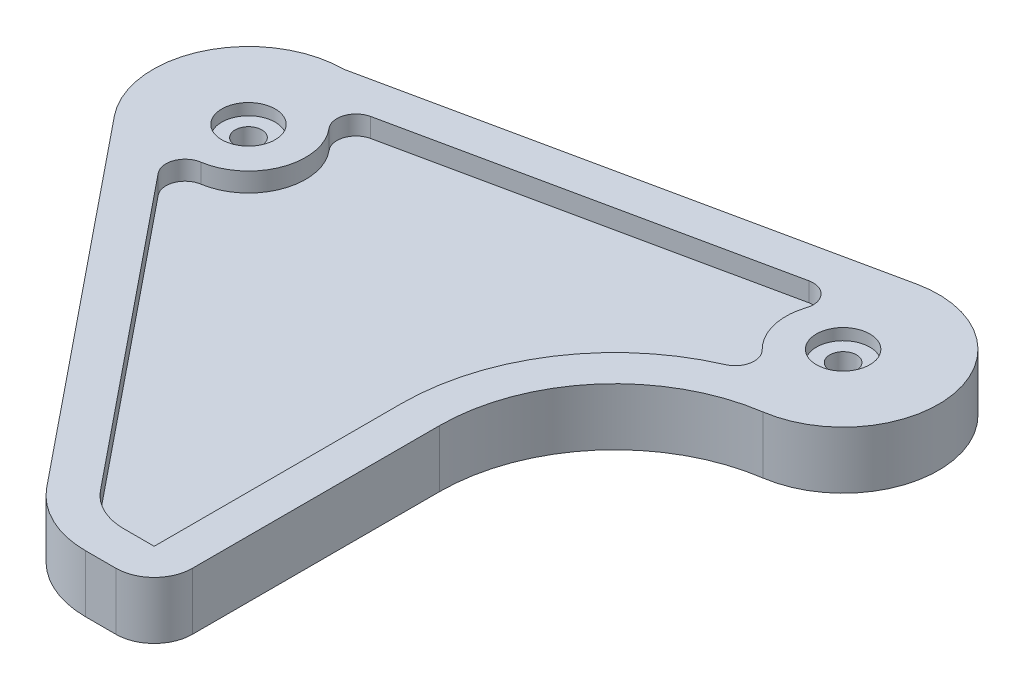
ISO-10303-21;
HEADER;
FILE_DESCRIPTION(('STEP AP214'),'2;1');
FILE_NAME('part.step','',(''),(''),'','','');
FILE_SCHEMA(('AUTOMOTIVE_DESIGN { 1 0 10303 214 1 1 1 1 }'));
ENDSEC;
DATA;
#1=APPLICATION_CONTEXT('core data for automotive mechanical design processes');
#2=APPLICATION_PROTOCOL_DEFINITION('international standard','automotive_design',2000,#1);
#3=PRODUCT_CONTEXT('',#1,'mechanical');
#4=PRODUCT('Part','Part','',(#3));
#5=PRODUCT_RELATED_PRODUCT_CATEGORY('part','',(#4));
#6=PRODUCT_DEFINITION_FORMATION('','',#4);
#7=PRODUCT_DEFINITION_CONTEXT('part definition',#1,'design');
#8=PRODUCT_DEFINITION('design','',#6,#7);
#9=PRODUCT_DEFINITION_SHAPE('','',#8);
#10=(LENGTH_UNIT() NAMED_UNIT(*) SI_UNIT(.MILLI.,.METRE.));
#11=(NAMED_UNIT(*) PLANE_ANGLE_UNIT() SI_UNIT($,.RADIAN.));
#12=(NAMED_UNIT(*) SI_UNIT($,.STERADIAN.) SOLID_ANGLE_UNIT());
#13=UNCERTAINTY_MEASURE_WITH_UNIT(LENGTH_MEASURE(1.E-05),#10,'distance_accuracy_value','');
#14=(GEOMETRIC_REPRESENTATION_CONTEXT(3) GLOBAL_UNCERTAINTY_ASSIGNED_CONTEXT((#13)) GLOBAL_UNIT_ASSIGNED_CONTEXT((#10,
#11,#12)) REPRESENTATION_CONTEXT('',''));
#15=CARTESIAN_POINT('',(0.,0.,0.));
#16=DIRECTION('',(0.,0.,1.));
#17=DIRECTION('',(1.,0.,0.));
#18=AXIS2_PLACEMENT_3D('',#15,#16,#17);
#19=CARTESIAN_POINT('',(0.,15.,0.));
#20=DIRECTION('',(0.,1.,0.));
#21=DIRECTION('',(0.,0.,1.));
#22=AXIS2_PLACEMENT_3D('',#19,#20,#21);
#23=PLANE('',#22);
#24=CARTESIAN_POINT('',(0.,15.,0.));
#25=DIRECTION('',(0.,1.,0.));
#26=DIRECTION('',(0.,0.,1.));
#27=AXIS2_PLACEMENT_3D('',#24,#25,#26);
#28=CIRCLE('',#27,6.9999987);
#29=CARTESIAN_POINT('',(0.,15.,6.9999987));
#30=VERTEX_POINT('',#29);
#31=EDGE_CURVE('E559',#30,#30,#28,.T.);
#32=ORIENTED_EDGE('',*,*,#31,.F.);
#33=EDGE_LOOP('',(#32));
#34=FACE_BOUND('',#33,.T.);
#35=CARTESIAN_POINT('',(129.,15.,-26.8612815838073));
#36=DIRECTION('',(0.,1.,0.));
#37=DIRECTION('',(0.,0.,1.));
#38=AXIS2_PLACEMENT_3D('',#35,#36,#37);
#39=CIRCLE('',#38,6.99999870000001);
#40=CARTESIAN_POINT('',(129.,15.,-19.8612828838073));
#41=VERTEX_POINT('',#40);
#42=EDGE_CURVE('E569',#41,#41,#39,.T.);
#43=ORIENTED_EDGE('',*,*,#42,.F.);
#44=EDGE_LOOP('',(#43));
#45=FACE_BOUND('',#44,.T.);
#46=CARTESIAN_POINT('',(0.,15.,0.));
#47=DIRECTION('',(0.,1.,0.));
#48=DIRECTION('',(0.,0.,1.));
#49=AXIS2_PLACEMENT_3D('',#46,#47,#48);
#50=CIRCLE('',#49,25.);
#51=CARTESIAN_POINT('',(0.,15.,-25.));
#52=VERTEX_POINT('',#51);
#53=CARTESIAN_POINT('',(-19.4286490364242,15.,15.733009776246));
#54=VERTEX_POINT('',#53);
#55=EDGE_CURVE('E294',#52,#54,#50,.T.);
#56=ORIENTED_EDGE('',*,*,#55,.T.);
#57=DIRECTION('',(0.629320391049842,0.,0.777145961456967));
#58=VECTOR('',#57,1.);
#59=CARTESIAN_POINT('',(55.9935980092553,15.,108.871728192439));
#60=LINE('',#59,#58);
#61=CARTESIAN_POINT('',(55.9935980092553,15.,108.871728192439));
#62=VERTEX_POINT('',#61);
#63=EDGE_CURVE('E296',#54,#62,#60,.T.);
#64=ORIENTED_EDGE('',*,*,#63,.T.);
#65=CARTESIAN_POINT('',(75.4222470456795,15.,93.1387184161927));
#66=DIRECTION('',(0.,1.,0.));
#67=DIRECTION('',(0.,0.,1.));
#68=AXIS2_PLACEMENT_3D('',#65,#66,#67);
#69=CIRCLE('',#68,25.);
#70=CARTESIAN_POINT('',(75.4222470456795,15.,118.138718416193));
#71=VERTEX_POINT('',#70);
#72=EDGE_CURVE('E298',#62,#71,#69,.T.);
#73=ORIENTED_EDGE('',*,*,#72,.T.);
#74=DIRECTION('',(1.,0.,0.));
#75=VECTOR('',#74,1.);
#76=CARTESIAN_POINT('',(75.4222470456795,15.,118.138718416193));
#77=LINE('',#76,#75);
#78=CARTESIAN_POINT('',(83.4222470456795,15.,118.138718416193));
#79=VERTEX_POINT('',#78);
#80=EDGE_CURVE('E300',#71,#79,#77,.T.);
#81=ORIENTED_EDGE('',*,*,#80,.T.);
#82=CARTESIAN_POINT('',(83.4222470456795,15.,108.138718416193));
#83=DIRECTION('',(0.,1.,0.));
#84=DIRECTION('',(0.,0.,1.));
#85=AXIS2_PLACEMENT_3D('',#82,#83,#84);
#86=CIRCLE('',#85,9.99999999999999);
#87=CARTESIAN_POINT('',(93.4222470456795,15.,108.138718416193));
#88=VERTEX_POINT('',#87);
#89=EDGE_CURVE('E302',#79,#88,#86,.T.);
#90=ORIENTED_EDGE('',*,*,#89,.T.);
#91=DIRECTION('',(0.,0.,-1.));
#92=VECTOR('',#91,1.);
#93=CARTESIAN_POINT('',(93.4222470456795,15.,43.369600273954));
#94=LINE('',#93,#92);
#95=CARTESIAN_POINT('',(93.4222470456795,15.,43.369600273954));
#96=VERTEX_POINT('',#95);
#97=EDGE_CURVE('E304',#88,#96,#94,.T.);
#98=ORIENTED_EDGE('',*,*,#97,.T.);
#99=CARTESIAN_POINT('',(139.422247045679,15.,43.369600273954));
#100=DIRECTION('',(0.,-1.,0.));
#101=DIRECTION('',(0.,0.,1.));
#102=AXIS2_PLACEMENT_3D('',#99,#100,#101);
#103=CIRCLE('',#102,46.);
#104=CARTESIAN_POINT('',(132.669805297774,15.,-2.13209783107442));
#105=VERTEX_POINT('',#104);
#106=EDGE_CURVE('E306',#96,#105,#103,.T.);
#107=ORIENTED_EDGE('',*,*,#106,.T.);
#108=CARTESIAN_POINT('',(129.,15.,-26.8612815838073));
#109=DIRECTION('',(0.,1.,0.));
#110=DIRECTION('',(0.,0.,-1.));
#111=AXIS2_PLACEMENT_3D('',#108,#109,#110);
#112=CIRCLE('',#111,25.);
#113=CARTESIAN_POINT('',(123.802207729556,15.,-51.3149716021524));
#114=VERTEX_POINT('',#113);
#115=EDGE_CURVE('E308',#105,#114,#112,.T.);
#116=ORIENTED_EDGE('',*,*,#115,.T.);
#117=DIRECTION('',(-0.978147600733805,0.,0.207911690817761));
#118=VECTOR('',#117,1.);
#119=CARTESIAN_POINT('',(0.,15.,-25.));
#120=LINE('',#119,#118);
#121=EDGE_CURVE('E52',#114,#52,#120,.T.);
#122=ORIENTED_EDGE('',*,*,#121,.T.);
#123=EDGE_LOOP('',(#56,#64,#73,#81,#90,#98,#107,#116,#122));
#124=FACE_BOUND('',#123,.T.);
#125=DIRECTION('',(-0.978147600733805,0.,0.207911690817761));
#126=VECTOR('',#125,1.);
#127=CARTESIAN_POINT('',(-136.322850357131,15.,14.1997222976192));
#128=LINE('',#127,#126);
#129=CARTESIAN_POINT('',(108.939311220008,15.,-37.9323594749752));
#130=VERTEX_POINT('',#129);
#131=CARTESIAN_POINT('',(14.2344029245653,15.,-17.802209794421));
#132=VERTEX_POINT('',#131);
#133=EDGE_CURVE('E190',#130,#132,#128,.T.);
#134=ORIENTED_EDGE('',*,*,#133,.F.);
#135=CARTESIAN_POINT('',(109.978869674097,15.,-33.0416214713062));
#136=DIRECTION('',(0.,1.,0.));
#137=DIRECTION('',(0.,0.,1.));
#138=AXIS2_PLACEMENT_3D('',#135,#136,#137);
#139=CIRCLE('',#138,5.00000000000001);
#140=CARTESIAN_POINT('',(114.734152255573,15.,-31.4965364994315));
#141=VERTEX_POINT('',#140);
#142=EDGE_CURVE('E44',#130,#141,#139,.F.);
#143=ORIENTED_EDGE('',*,*,#142,.T.);
#144=CARTESIAN_POINT('',(129.,15.,-26.8612815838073));
#145=DIRECTION('',(0.,1.,0.));
#146=DIRECTION('',(0.,0.,1.));
#147=AXIS2_PLACEMENT_3D('',#144,#145,#146);
#148=CIRCLE('',#147,15.);
#149=CARTESIAN_POINT('',(118.526682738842,15.,-16.1230496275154));
#150=VERTEX_POINT('',#149);
#151=EDGE_CURVE('E222',#141,#150,#148,.T.);
#152=ORIENTED_EDGE('',*,*,#151,.T.);
#153=CARTESIAN_POINT('',(115.035576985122,15.,-12.5436389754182));
#154=DIRECTION('',(0.,1.,0.));
#155=DIRECTION('',(0.,0.,1.));
#156=AXIS2_PLACEMENT_3D('',#153,#154,#155);
#157=CIRCLE('',#156,5.);
#158=CARTESIAN_POINT('',(117.034484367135,15.,-7.96058657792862));
#159=VERTEX_POINT('',#158);
#160=EDGE_CURVE('E219',#159,#150,#157,.T.);
#161=ORIENTED_EDGE('',*,*,#160,.F.);
#162=CARTESIAN_POINT('',(139.422247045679,15.,43.369600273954));
#163=DIRECTION('',(0.,1.,0.));
#164=DIRECTION('',(0.,0.,1.));
#165=AXIS2_PLACEMENT_3D('',#162,#163,#164);
#166=CIRCLE('',#165,56.);
#167=CARTESIAN_POINT('',(83.4222470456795,15.,43.369600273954));
#168=VERTEX_POINT('',#167);
#169=EDGE_CURVE('E216',#159,#168,#166,.T.);
#170=ORIENTED_EDGE('',*,*,#169,.T.);
#171=DIRECTION('',(0.,0.,-1.));
#172=VECTOR('',#171,1.);
#173=CARTESIAN_POINT('',(83.4222470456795,15.,11.7196443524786));
#174=LINE('',#173,#172);
#175=CARTESIAN_POINT('',(83.4222470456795,15.,108.138718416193));
#176=VERTEX_POINT('',#175);
#177=EDGE_CURVE('E213',#176,#168,#174,.T.);
#178=ORIENTED_EDGE('',*,*,#177,.F.);
#179=DIRECTION('',(1.,0.,0.));
#180=VECTOR('',#179,1.);
#181=CARTESIAN_POINT('',(-136.850007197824,15.,108.138718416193));
#182=LINE('',#181,#180);
#183=CARTESIAN_POINT('',(75.4222470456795,15.,108.138718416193));
#184=VERTEX_POINT('',#183);
#185=EDGE_CURVE('E210',#184,#176,#182,.T.);
#186=ORIENTED_EDGE('',*,*,#185,.F.);
#187=CARTESIAN_POINT('',(75.4222470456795,15.,93.1387184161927));
#188=DIRECTION('',(0.,1.,0.));
#189=DIRECTION('',(0.,0.,1.));
#190=AXIS2_PLACEMENT_3D('',#187,#188,#189);
#191=CIRCLE('',#190,15.);
#192=CARTESIAN_POINT('',(63.765057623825,15.,102.57852428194));
#193=VERTEX_POINT('',#192);
#194=EDGE_CURVE('E207',#193,#184,#191,.T.);
#195=ORIENTED_EDGE('',*,*,#194,.F.);
#196=DIRECTION('',(0.629320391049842,0.,0.777145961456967));
#197=VECTOR('',#196,1.);
#198=CARTESIAN_POINT('',(-60.1240638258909,15.,-50.4117995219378));
#199=LINE('',#198,#197);
#200=CARTESIAN_POINT('',(-0.757040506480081,15.,22.9003687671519));
#201=VERTEX_POINT('',#200);
#202=EDGE_CURVE('E204',#201,#193,#199,.T.);
#203=ORIENTED_EDGE('',*,*,#202,.F.);
#204=CARTESIAN_POINT('',(3.12868930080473,15.,19.7537668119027));
#205=DIRECTION('',(0.,1.,0.));
#206=DIRECTION('',(0.,0.,1.));
#207=AXIS2_PLACEMENT_3D('',#204,#205,#206);
#208=CIRCLE('',#207,5.);
#209=CARTESIAN_POINT('',(2.34651697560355,15.,14.815325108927));
#210=VERTEX_POINT('',#209);
#211=EDGE_CURVE('E198',#210,#201,#208,.T.);
#212=ORIENTED_EDGE('',*,*,#211,.F.);
#213=CARTESIAN_POINT('',(0.,15.,0.));
#214=DIRECTION('',(0.,1.,0.));
#215=DIRECTION('',(0.,0.,1.));
#216=AXIS2_PLACEMENT_3D('',#213,#214,#215);
#217=CIRCLE('',#216,15.);
#218=CARTESIAN_POINT('',(11.4554710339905,15.,-9.683603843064));
#219=VERTEX_POINT('',#218);
#220=EDGE_CURVE('E196',#210,#219,#217,.T.);
#221=ORIENTED_EDGE('',*,*,#220,.T.);
#222=CARTESIAN_POINT('',(15.2739613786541,15.,-12.911471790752));
#223=DIRECTION('',(0.,1.,0.));
#224=DIRECTION('',(0.,0.,1.));
#225=AXIS2_PLACEMENT_3D('',#222,#223,#224);
#226=CIRCLE('',#225,5.);
#227=EDGE_CURVE('E179',#132,#219,#226,.T.);
#228=ORIENTED_EDGE('',*,*,#227,.F.);
#229=EDGE_LOOP('',(#134,#143,#152,#161,#170,#178,#186,#195,#203,#212,#221,#228));
#230=FACE_BOUND('',#229,.T.);
#231=ADVANCED_FACE('F29',(#34,#45,#124,#230),#23,.T.);
#232=CARTESIAN_POINT('',(0.,15.,0.));
#233=DIRECTION('',(0.,-1.,0.));
#234=DIRECTION('',(0.,0.,-1.));
#235=AXIS2_PLACEMENT_3D('',#232,#233,#234);
#236=CYLINDRICAL_SURFACE('',#235,25.);
#237=CARTESIAN_POINT('',(0.,0.,0.));
#238=DIRECTION('',(0.,1.,0.));
#239=DIRECTION('',(0.,0.,1.));
#240=AXIS2_PLACEMENT_3D('',#237,#238,#239);
#241=CIRCLE('',#240,25.);
#242=CARTESIAN_POINT('',(0.,0.,-25.));
#243=VERTEX_POINT('',#242);
#244=CARTESIAN_POINT('',(-19.4286490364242,0.,15.733009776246));
#245=VERTEX_POINT('',#244);
#246=EDGE_CURVE('E257',#243,#245,#241,.T.);
#247=ORIENTED_EDGE('',*,*,#246,.T.);
#248=DIRECTION('',(0.,-1.,0.));
#249=VECTOR('',#248,1.);
#250=CARTESIAN_POINT('',(-19.4286490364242,15.,15.733009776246));
#251=LINE('',#250,#249);
#252=EDGE_CURVE('E11',#54,#245,#251,.T.);
#253=ORIENTED_EDGE('',*,*,#252,.F.);
#254=ORIENTED_EDGE('',*,*,#55,.F.);
#255=DIRECTION('',(0.,-1.,0.));
#256=VECTOR('',#255,1.);
#257=CARTESIAN_POINT('',(0.,15.,-25.));
#258=LINE('',#257,#256);
#259=EDGE_CURVE('E311',#52,#243,#258,.T.);
#260=ORIENTED_EDGE('',*,*,#259,.T.);
#261=EDGE_LOOP('',(#247,#253,#254,#260));
#262=FACE_BOUND('',#261,.T.);
#263=ADVANCED_FACE('F31',(#262),#236,.T.);
#264=CARTESIAN_POINT('',(55.9935980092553,15.,108.871728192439));
#265=DIRECTION('',(0.777145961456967,0.,-0.629320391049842));
#266=DIRECTION('',(-0.629320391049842,0.,-0.777145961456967));
#267=AXIS2_PLACEMENT_3D('',#264,#265,#266);
#268=PLANE('',#267);
#269=DIRECTION('',(0.629320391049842,0.,0.777145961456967));
#270=VECTOR('',#269,1.);
#271=CARTESIAN_POINT('',(55.9935980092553,0.,108.871728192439));
#272=LINE('',#271,#270);
#273=CARTESIAN_POINT('',(55.9935980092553,0.,108.871728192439));
#274=VERTEX_POINT('',#273);
#275=EDGE_CURVE('E278',#245,#274,#272,.T.);
#276=ORIENTED_EDGE('',*,*,#275,.T.);
#277=DIRECTION('',(0.,-1.,0.));
#278=VECTOR('',#277,1.);
#279=CARTESIAN_POINT('',(55.9935980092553,15.,108.871728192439));
#280=LINE('',#279,#278);
#281=EDGE_CURVE('E37',#62,#274,#280,.T.);
#282=ORIENTED_EDGE('',*,*,#281,.F.);
#283=ORIENTED_EDGE('',*,*,#63,.F.);
#284=ORIENTED_EDGE('',*,*,#252,.T.);
#285=EDGE_LOOP('',(#276,#282,#283,#284));
#286=FACE_BOUND('',#285,.T.);
#287=ADVANCED_FACE('F357',(#286),#268,.F.);
#288=CARTESIAN_POINT('',(75.4222470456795,15.,93.1387184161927));
#289=DIRECTION('',(0.,-1.,0.));
#290=DIRECTION('',(0.,0.,-1.));
#291=AXIS2_PLACEMENT_3D('',#288,#289,#290);
#292=CYLINDRICAL_SURFACE('',#291,25.);
#293=CARTESIAN_POINT('',(75.4222470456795,0.,93.1387184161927));
#294=DIRECTION('',(0.,1.,0.));
#295=DIRECTION('',(0.,0.,1.));
#296=AXIS2_PLACEMENT_3D('',#293,#294,#295);
#297=CIRCLE('',#296,25.);
#298=CARTESIAN_POINT('',(75.4222470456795,0.,118.138718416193));
#299=VERTEX_POINT('',#298);
#300=EDGE_CURVE('E280',#274,#299,#297,.T.);
#301=ORIENTED_EDGE('',*,*,#300,.T.);
#302=DIRECTION('',(0.,-1.,0.));
#303=VECTOR('',#302,1.);
#304=CARTESIAN_POINT('',(75.4222470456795,15.,118.138718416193));
#305=LINE('',#304,#303);
#306=EDGE_CURVE('E329',#71,#299,#305,.T.);
#307=ORIENTED_EDGE('',*,*,#306,.F.);
#308=ORIENTED_EDGE('',*,*,#72,.F.);
#309=ORIENTED_EDGE('',*,*,#281,.T.);
#310=EDGE_LOOP('',(#301,#307,#308,#309));
#311=FACE_BOUND('',#310,.T.);
#312=ADVANCED_FACE('F336',(#311),#292,.T.);
#313=CARTESIAN_POINT('',(75.4222470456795,15.,118.138718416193));
#314=DIRECTION('',(0.,0.,-1.));
#315=DIRECTION('',(-1.,0.,0.));
#316=AXIS2_PLACEMENT_3D('',#313,#314,#315);
#317=PLANE('',#316);
#318=DIRECTION('',(1.,0.,0.));
#319=VECTOR('',#318,1.);
#320=CARTESIAN_POINT('',(75.4222470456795,0.,118.138718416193));
#321=LINE('',#320,#319);
#322=CARTESIAN_POINT('',(83.4222470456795,0.,118.138718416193));
#323=VERTEX_POINT('',#322);
#324=EDGE_CURVE('E282',#299,#323,#321,.T.);
#325=ORIENTED_EDGE('',*,*,#324,.T.);
#326=DIRECTION('',(0.,-1.,0.));
#327=VECTOR('',#326,1.);
#328=CARTESIAN_POINT('',(83.4222470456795,15.,118.138718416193));
#329=LINE('',#328,#327);
#330=EDGE_CURVE('E326',#79,#323,#329,.T.);
#331=ORIENTED_EDGE('',*,*,#330,.F.);
#332=ORIENTED_EDGE('',*,*,#80,.F.);
#333=ORIENTED_EDGE('',*,*,#306,.T.);
#334=EDGE_LOOP('',(#325,#331,#332,#333));
#335=FACE_BOUND('',#334,.T.);
#336=ADVANCED_FACE('F347',(#335),#317,.F.);
#337=CARTESIAN_POINT('',(83.4222470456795,15.,108.138718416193));
#338=DIRECTION('',(0.,-1.,0.));
#339=DIRECTION('',(0.,0.,-1.));
#340=AXIS2_PLACEMENT_3D('',#337,#338,#339);
#341=CYLINDRICAL_SURFACE('',#340,9.99999999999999);
#342=CARTESIAN_POINT('',(83.4222470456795,0.,108.138718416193));
#343=DIRECTION('',(0.,1.,0.));
#344=DIRECTION('',(0.,0.,1.));
#345=AXIS2_PLACEMENT_3D('',#342,#343,#344);
#346=CIRCLE('',#345,9.99999999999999);
#347=CARTESIAN_POINT('',(93.4222470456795,0.,108.138718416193));
#348=VERTEX_POINT('',#347);
#349=EDGE_CURVE('E284',#323,#348,#346,.T.);
#350=ORIENTED_EDGE('',*,*,#349,.T.);
#351=DIRECTION('',(0.,-1.,0.));
#352=VECTOR('',#351,1.);
#353=CARTESIAN_POINT('',(93.4222470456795,15.,108.138718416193));
#354=LINE('',#353,#352);
#355=EDGE_CURVE('E323',#88,#348,#354,.T.);
#356=ORIENTED_EDGE('',*,*,#355,.F.);
#357=ORIENTED_EDGE('',*,*,#89,.F.);
#358=ORIENTED_EDGE('',*,*,#330,.T.);
#359=EDGE_LOOP('',(#350,#356,#357,#358));
#360=FACE_BOUND('',#359,.T.);
#361=ADVANCED_FACE('F351',(#360),#341,.T.);
#362=CARTESIAN_POINT('',(93.4222470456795,15.,43.369600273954));
#363=DIRECTION('',(-1.,0.,0.));
#364=DIRECTION('',(0.,0.,1.));
#365=AXIS2_PLACEMENT_3D('',#362,#363,#364);
#366=PLANE('',#365);
#367=DIRECTION('',(0.,0.,-1.));
#368=VECTOR('',#367,1.);
#369=CARTESIAN_POINT('',(93.4222470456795,0.,43.369600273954));
#370=LINE('',#369,#368);
#371=CARTESIAN_POINT('',(93.4222470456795,0.,43.369600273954));
#372=VERTEX_POINT('',#371);
#373=EDGE_CURVE('E286',#348,#372,#370,.T.);
#374=ORIENTED_EDGE('',*,*,#373,.T.);
#375=DIRECTION('',(0.,-1.,0.));
#376=VECTOR('',#375,1.);
#377=CARTESIAN_POINT('',(93.4222470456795,15.,43.369600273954));
#378=LINE('',#377,#376);
#379=EDGE_CURVE('E320',#96,#372,#378,.T.);
#380=ORIENTED_EDGE('',*,*,#379,.F.);
#381=ORIENTED_EDGE('',*,*,#97,.F.);
#382=ORIENTED_EDGE('',*,*,#355,.T.);
#383=EDGE_LOOP('',(#374,#380,#381,#382));
#384=FACE_BOUND('',#383,.T.);
#385=ADVANCED_FACE('F373',(#384),#366,.F.);
#386=CARTESIAN_POINT('',(139.422247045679,15.,43.369600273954));
#387=DIRECTION('',(0.,-1.,0.));
#388=DIRECTION('',(0.,0.,-1.));
#389=AXIS2_PLACEMENT_3D('',#386,#387,#388);
#390=CYLINDRICAL_SURFACE('',#389,46.);
#391=CARTESIAN_POINT('',(139.422247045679,0.,43.369600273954));
#392=DIRECTION('',(0.,-1.,0.));
#393=DIRECTION('',(0.,0.,1.));
#394=AXIS2_PLACEMENT_3D('',#391,#392,#393);
#395=CIRCLE('',#394,46.);
#396=CARTESIAN_POINT('',(132.669805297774,0.,-2.13209783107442));
#397=VERTEX_POINT('',#396);
#398=EDGE_CURVE('E288',#372,#397,#395,.T.);
#399=ORIENTED_EDGE('',*,*,#398,.T.);
#400=DIRECTION('',(0.,-1.,0.));
#401=VECTOR('',#400,1.);
#402=CARTESIAN_POINT('',(132.669805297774,15.,-2.13209783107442));
#403=LINE('',#402,#401);
#404=EDGE_CURVE('E317',#105,#397,#403,.T.);
#405=ORIENTED_EDGE('',*,*,#404,.F.);
#406=ORIENTED_EDGE('',*,*,#106,.F.);
#407=ORIENTED_EDGE('',*,*,#379,.T.);
#408=EDGE_LOOP('',(#399,#405,#406,#407));
#409=FACE_BOUND('',#408,.T.);
#410=ADVANCED_FACE('F371',(#409),#390,.F.);
#411=CARTESIAN_POINT('',(129.,15.,-26.8612815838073));
#412=DIRECTION('',(0.,-1.,0.));
#413=DIRECTION('',(0.,0.,-1.));
#414=AXIS2_PLACEMENT_3D('',#411,#412,#413);
#415=CYLINDRICAL_SURFACE('',#414,25.);
#416=CARTESIAN_POINT('',(129.,0.,-26.8612815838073));
#417=DIRECTION('',(0.,1.,0.));
#418=DIRECTION('',(0.,0.,-1.));
#419=AXIS2_PLACEMENT_3D('',#416,#417,#418);
#420=CIRCLE('',#419,25.);
#421=CARTESIAN_POINT('',(123.802207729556,0.,-51.3149716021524));
#422=VERTEX_POINT('',#421);
#423=EDGE_CURVE('E290',#397,#422,#420,.T.);
#424=ORIENTED_EDGE('',*,*,#423,.T.);
#425=DIRECTION('',(0.,-1.,0.));
#426=VECTOR('',#425,1.);
#427=CARTESIAN_POINT('',(123.802207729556,15.,-51.3149716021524));
#428=LINE('',#427,#426);
#429=EDGE_CURVE('E314',#114,#422,#428,.T.);
#430=ORIENTED_EDGE('',*,*,#429,.F.);
#431=ORIENTED_EDGE('',*,*,#115,.F.);
#432=ORIENTED_EDGE('',*,*,#404,.T.);
#433=EDGE_LOOP('',(#424,#430,#431,#432));
#434=FACE_BOUND('',#433,.T.);
#435=ADVANCED_FACE('F367',(#434),#415,.T.);
#436=CARTESIAN_POINT('',(0.,15.,-25.));
#437=DIRECTION('',(0.207911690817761,0.,0.978147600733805));
#438=DIRECTION('',(0.978147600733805,0.,-0.207911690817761));
#439=AXIS2_PLACEMENT_3D('',#436,#437,#438);
#440=PLANE('',#439);
#441=DIRECTION('',(-0.978147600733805,0.,0.207911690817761));
#442=VECTOR('',#441,1.);
#443=CARTESIAN_POINT('',(0.,0.,-25.));
#444=LINE('',#443,#442);
#445=EDGE_CURVE('E292',#422,#243,#444,.T.);
#446=ORIENTED_EDGE('',*,*,#445,.T.);
#447=ORIENTED_EDGE('',*,*,#259,.F.);
#448=ORIENTED_EDGE('',*,*,#121,.F.);
#449=ORIENTED_EDGE('',*,*,#429,.T.);
#450=EDGE_LOOP('',(#446,#447,#448,#449));
#451=FACE_BOUND('',#450,.T.);
#452=ADVANCED_FACE('F363',(#451),#440,.F.);
#453=CARTESIAN_POINT('',(0.,0.,0.));
#454=DIRECTION('',(0.,1.,0.));
#455=DIRECTION('',(0.,0.,1.));
#456=AXIS2_PLACEMENT_3D('',#453,#454,#455);
#457=PLANE('',#456);
#458=CARTESIAN_POINT('',(0.,0.,0.));
#459=DIRECTION('',(0.,1.,0.));
#460=DIRECTION('',(0.,0.,1.));
#461=AXIS2_PLACEMENT_3D('',#458,#459,#460);
#462=CIRCLE('',#461,3.5000057);
#463=CARTESIAN_POINT('',(0.,0.,3.5000057));
#464=VERTEX_POINT('',#463);
#465=EDGE_CURVE('E566',#464,#464,#462,.T.);
#466=ORIENTED_EDGE('',*,*,#465,.T.);
#467=EDGE_LOOP('',(#466));
#468=FACE_BOUND('',#467,.T.);
#469=CARTESIAN_POINT('',(129.,0.,-26.8612815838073));
#470=DIRECTION('',(0.,1.,0.));
#471=DIRECTION('',(0.,0.,1.));
#472=AXIS2_PLACEMENT_3D('',#469,#470,#471);
#473=CIRCLE('',#472,3.5000057);
#474=CARTESIAN_POINT('',(129.,0.,-23.3612758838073));
#475=VERTEX_POINT('',#474);
#476=EDGE_CURVE('E578',#475,#475,#473,.T.);
#477=ORIENTED_EDGE('',*,*,#476,.T.);
#478=EDGE_LOOP('',(#477));
#479=FACE_BOUND('',#478,.T.);
#480=ORIENTED_EDGE('',*,*,#246,.F.);
#481=ORIENTED_EDGE('',*,*,#445,.F.);
#482=ORIENTED_EDGE('',*,*,#423,.F.);
#483=ORIENTED_EDGE('',*,*,#398,.F.);
#484=ORIENTED_EDGE('',*,*,#373,.F.);
#485=ORIENTED_EDGE('',*,*,#349,.F.);
#486=ORIENTED_EDGE('',*,*,#324,.F.);
#487=ORIENTED_EDGE('',*,*,#300,.F.);
#488=ORIENTED_EDGE('',*,*,#275,.F.);
#489=EDGE_LOOP('',(#480,#481,#482,#483,#484,#485,#486,#487,#488));
#490=FACE_BOUND('',#489,.T.);
#491=ADVANCED_FACE('F342',(#468,#479,#490),#457,.F.);
#492=CARTESIAN_POINT('',(109.978869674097,10.,-33.0416214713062));
#493=DIRECTION('',(0.,1.,0.));
#494=DIRECTION('',(0.,0.,1.));
#495=AXIS2_PLACEMENT_3D('',#492,#493,#494);
#496=CYLINDRICAL_SURFACE('',#495,5.00000000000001);
#497=ORIENTED_EDGE('',*,*,#142,.F.);
#498=DIRECTION('',(0.,1.,0.));
#499=VECTOR('',#498,1.);
#500=CARTESIAN_POINT('',(108.939311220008,10.,-37.9323594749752));
#501=LINE('',#500,#499);
#502=CARTESIAN_POINT('',(108.939311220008,10.,-37.9323594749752));
#503=VERTEX_POINT('',#502);
#504=EDGE_CURVE('E187',#503,#130,#501,.T.);
#505=ORIENTED_EDGE('',*,*,#504,.F.);
#506=CARTESIAN_POINT('',(109.978869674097,10.,-33.0416214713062));
#507=DIRECTION('',(0.,1.,0.));
#508=DIRECTION('',(0.,0.,1.));
#509=AXIS2_PLACEMENT_3D('',#506,#507,#508);
#510=CIRCLE('',#509,5.00000000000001);
#511=CARTESIAN_POINT('',(114.734152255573,10.,-31.4965364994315));
#512=VERTEX_POINT('',#511);
#513=EDGE_CURVE('E225',#503,#512,#510,.F.);
#514=ORIENTED_EDGE('',*,*,#513,.T.);
#515=DIRECTION('',(0.,1.,0.));
#516=VECTOR('',#515,1.);
#517=CARTESIAN_POINT('',(114.734152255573,10.,-31.4965364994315));
#518=LINE('',#517,#516);
#519=EDGE_CURVE('E255',#512,#141,#518,.T.);
#520=ORIENTED_EDGE('',*,*,#519,.T.);
#521=EDGE_LOOP('',(#497,#505,#514,#520));
#522=FACE_BOUND('',#521,.T.);
#523=ADVANCED_FACE('F410',(#522),#496,.F.);
#524=CARTESIAN_POINT('',(129.,10.,-26.8612815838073));
#525=DIRECTION('',(0.,1.,0.));
#526=DIRECTION('',(0.,0.,1.));
#527=AXIS2_PLACEMENT_3D('',#524,#525,#526);
#528=CYLINDRICAL_SURFACE('',#527,15.);
#529=ORIENTED_EDGE('',*,*,#151,.F.);
#530=ORIENTED_EDGE('',*,*,#519,.F.);
#531=CARTESIAN_POINT('',(129.,10.,-26.8612815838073));
#532=DIRECTION('',(0.,1.,0.));
#533=DIRECTION('',(0.,0.,1.));
#534=AXIS2_PLACEMENT_3D('',#531,#532,#533);
#535=CIRCLE('',#534,15.);
#536=CARTESIAN_POINT('',(118.526682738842,10.,-16.1230496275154));
#537=VERTEX_POINT('',#536);
#538=EDGE_CURVE('E253',#512,#537,#535,.T.);
#539=ORIENTED_EDGE('',*,*,#538,.T.);
#540=DIRECTION('',(0.,1.,0.));
#541=VECTOR('',#540,1.);
#542=CARTESIAN_POINT('',(118.526682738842,10.,-16.1230496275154));
#543=LINE('',#542,#541);
#544=EDGE_CURVE('E258',#537,#150,#543,.T.);
#545=ORIENTED_EDGE('',*,*,#544,.T.);
#546=EDGE_LOOP('',(#529,#530,#539,#545));
#547=FACE_BOUND('',#546,.T.);
#548=ADVANCED_FACE('F414',(#547),#528,.T.);
#549=CARTESIAN_POINT('',(115.035576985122,10.,-12.5436389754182));
#550=DIRECTION('',(0.,1.,0.));
#551=DIRECTION('',(0.,0.,1.));
#552=AXIS2_PLACEMENT_3D('',#549,#550,#551);
#553=CYLINDRICAL_SURFACE('',#552,5.);
#554=ORIENTED_EDGE('',*,*,#160,.T.);
#555=ORIENTED_EDGE('',*,*,#544,.F.);
#556=CARTESIAN_POINT('',(115.035576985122,10.,-12.5436389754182));
#557=DIRECTION('',(0.,1.,0.));
#558=DIRECTION('',(0.,0.,1.));
#559=AXIS2_PLACEMENT_3D('',#556,#557,#558);
#560=CIRCLE('',#559,5.);
#561=CARTESIAN_POINT('',(117.034484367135,10.,-7.96058657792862));
#562=VERTEX_POINT('',#561);
#563=EDGE_CURVE('E250',#562,#537,#560,.T.);
#564=ORIENTED_EDGE('',*,*,#563,.F.);
#565=DIRECTION('',(0.,1.,0.));
#566=VECTOR('',#565,1.);
#567=CARTESIAN_POINT('',(117.034484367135,10.,-7.96058657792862));
#568=LINE('',#567,#566);
#569=EDGE_CURVE('E260',#562,#159,#568,.T.);
#570=ORIENTED_EDGE('',*,*,#569,.T.);
#571=EDGE_LOOP('',(#554,#555,#564,#570));
#572=FACE_BOUND('',#571,.T.);
#573=ADVANCED_FACE('F420',(#572),#553,.F.);
#574=CARTESIAN_POINT('',(139.422247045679,10.,43.369600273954));
#575=DIRECTION('',(0.,1.,0.));
#576=DIRECTION('',(0.,0.,1.));
#577=AXIS2_PLACEMENT_3D('',#574,#575,#576);
#578=CYLINDRICAL_SURFACE('',#577,56.);
#579=ORIENTED_EDGE('',*,*,#169,.F.);
#580=ORIENTED_EDGE('',*,*,#569,.F.);
#581=CARTESIAN_POINT('',(139.422247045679,10.,43.369600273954));
#582=DIRECTION('',(0.,1.,0.));
#583=DIRECTION('',(0.,0.,1.));
#584=AXIS2_PLACEMENT_3D('',#581,#582,#583);
#585=CIRCLE('',#584,56.);
#586=CARTESIAN_POINT('',(83.4222470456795,10.,43.369600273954));
#587=VERTEX_POINT('',#586);
#588=EDGE_CURVE('E248',#562,#587,#585,.T.);
#589=ORIENTED_EDGE('',*,*,#588,.T.);
#590=DIRECTION('',(0.,1.,0.));
#591=VECTOR('',#590,1.);
#592=CARTESIAN_POINT('',(83.4222470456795,10.,43.369600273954));
#593=LINE('',#592,#591);
#594=EDGE_CURVE('E262',#587,#168,#593,.T.);
#595=ORIENTED_EDGE('',*,*,#594,.T.);
#596=EDGE_LOOP('',(#579,#580,#589,#595));
#597=FACE_BOUND('',#596,.T.);
#598=ADVANCED_FACE('F428',(#597),#578,.T.);
#599=CARTESIAN_POINT('',(83.4222470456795,10.,11.7196443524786));
#600=DIRECTION('',(1.,0.,0.));
#601=DIRECTION('',(0.,0.,-1.));
#602=AXIS2_PLACEMENT_3D('',#599,#600,#601);
#603=PLANE('',#602);
#604=ORIENTED_EDGE('',*,*,#177,.T.);
#605=ORIENTED_EDGE('',*,*,#594,.F.);
#606=DIRECTION('',(0.,0.,-1.));
#607=VECTOR('',#606,1.);
#608=CARTESIAN_POINT('',(83.4222470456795,10.,11.7196443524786));
#609=LINE('',#608,#607);
#610=CARTESIAN_POINT('',(83.4222470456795,10.,108.138718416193));
#611=VERTEX_POINT('',#610);
#612=EDGE_CURVE('E245',#611,#587,#609,.T.);
#613=ORIENTED_EDGE('',*,*,#612,.F.);
#614=DIRECTION('',(0.,1.,0.));
#615=VECTOR('',#614,1.);
#616=CARTESIAN_POINT('',(83.4222470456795,10.,108.138718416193));
#617=LINE('',#616,#615);
#618=EDGE_CURVE('E264',#611,#176,#617,.T.);
#619=ORIENTED_EDGE('',*,*,#618,.T.);
#620=EDGE_LOOP('',(#604,#605,#613,#619));
#621=FACE_BOUND('',#620,.T.);
#622=ADVANCED_FACE('F436',(#621),#603,.F.);
#623=CARTESIAN_POINT('',(-136.850007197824,10.,108.138718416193));
#624=DIRECTION('',(0.,0.,1.));
#625=DIRECTION('',(1.,0.,0.));
#626=AXIS2_PLACEMENT_3D('',#623,#624,#625);
#627=PLANE('',#626);
#628=ORIENTED_EDGE('',*,*,#185,.T.);
#629=ORIENTED_EDGE('',*,*,#618,.F.);
#630=DIRECTION('',(1.,0.,0.));
#631=VECTOR('',#630,1.);
#632=CARTESIAN_POINT('',(-136.850007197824,10.,108.138718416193));
#633=LINE('',#632,#631);
#634=CARTESIAN_POINT('',(75.4222470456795,10.,108.138718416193));
#635=VERTEX_POINT('',#634);
#636=EDGE_CURVE('E242',#635,#611,#633,.T.);
#637=ORIENTED_EDGE('',*,*,#636,.F.);
#638=DIRECTION('',(0.,1.,0.));
#639=VECTOR('',#638,1.);
#640=CARTESIAN_POINT('',(75.4222470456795,10.,108.138718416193));
#641=LINE('',#640,#639);
#642=EDGE_CURVE('E266',#635,#184,#641,.T.);
#643=ORIENTED_EDGE('',*,*,#642,.T.);
#644=EDGE_LOOP('',(#628,#629,#637,#643));
#645=FACE_BOUND('',#644,.T.);
#646=ADVANCED_FACE('F444',(#645),#627,.F.);
#647=CARTESIAN_POINT('',(75.4222470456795,10.,93.1387184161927));
#648=DIRECTION('',(0.,1.,0.));
#649=DIRECTION('',(0.,0.,1.));
#650=AXIS2_PLACEMENT_3D('',#647,#648,#649);
#651=CYLINDRICAL_SURFACE('',#650,15.);
#652=ORIENTED_EDGE('',*,*,#194,.T.);
#653=ORIENTED_EDGE('',*,*,#642,.F.);
#654=CARTESIAN_POINT('',(75.4222470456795,10.,93.1387184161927));
#655=DIRECTION('',(0.,1.,0.));
#656=DIRECTION('',(0.,0.,1.));
#657=AXIS2_PLACEMENT_3D('',#654,#655,#656);
#658=CIRCLE('',#657,15.);
#659=CARTESIAN_POINT('',(63.765057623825,10.,102.57852428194));
#660=VERTEX_POINT('',#659);
#661=EDGE_CURVE('E239',#660,#635,#658,.T.);
#662=ORIENTED_EDGE('',*,*,#661,.F.);
#663=DIRECTION('',(0.,1.,0.));
#664=VECTOR('',#663,1.);
#665=CARTESIAN_POINT('',(63.765057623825,10.,102.57852428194));
#666=LINE('',#665,#664);
#667=EDGE_CURVE('E268',#660,#193,#666,.T.);
#668=ORIENTED_EDGE('',*,*,#667,.T.);
#669=EDGE_LOOP('',(#652,#653,#662,#668));
#670=FACE_BOUND('',#669,.T.);
#671=ADVANCED_FACE('F452',(#670),#651,.F.);
#672=CARTESIAN_POINT('',(-60.1240638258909,10.,-50.4117995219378));
#673=DIRECTION('',(-0.777145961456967,0.,0.629320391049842));
#674=DIRECTION('',(0.629320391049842,0.,0.777145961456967));
#675=AXIS2_PLACEMENT_3D('',#672,#673,#674);
#676=PLANE('',#675);
#677=ORIENTED_EDGE('',*,*,#202,.T.);
#678=ORIENTED_EDGE('',*,*,#667,.F.);
#679=DIRECTION('',(0.629320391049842,0.,0.777145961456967));
#680=VECTOR('',#679,1.);
#681=CARTESIAN_POINT('',(-60.1240638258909,10.,-50.4117995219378));
#682=LINE('',#681,#680);
#683=CARTESIAN_POINT('',(-0.757040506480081,10.,22.9003687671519));
#684=VERTEX_POINT('',#683);
#685=EDGE_CURVE('E236',#684,#660,#682,.T.);
#686=ORIENTED_EDGE('',*,*,#685,.F.);
#687=DIRECTION('',(0.,1.,0.));
#688=VECTOR('',#687,1.);
#689=CARTESIAN_POINT('',(-0.757040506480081,10.,22.9003687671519));
#690=LINE('',#689,#688);
#691=EDGE_CURVE('E270',#684,#201,#690,.T.);
#692=ORIENTED_EDGE('',*,*,#691,.T.);
#693=EDGE_LOOP('',(#677,#678,#686,#692));
#694=FACE_BOUND('',#693,.T.);
#695=ADVANCED_FACE('F460',(#694),#676,.F.);
#696=CARTESIAN_POINT('',(3.12868930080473,10.,19.7537668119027));
#697=DIRECTION('',(0.,1.,0.));
#698=DIRECTION('',(0.,0.,1.));
#699=AXIS2_PLACEMENT_3D('',#696,#697,#698);
#700=CYLINDRICAL_SURFACE('',#699,5.);
#701=ORIENTED_EDGE('',*,*,#211,.T.);
#702=ORIENTED_EDGE('',*,*,#691,.F.);
#703=CARTESIAN_POINT('',(3.12868930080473,10.,19.7537668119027));
#704=DIRECTION('',(0.,1.,0.));
#705=DIRECTION('',(0.,0.,1.));
#706=AXIS2_PLACEMENT_3D('',#703,#704,#705);
#707=CIRCLE('',#706,5.);
#708=CARTESIAN_POINT('',(2.34651697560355,10.,14.815325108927));
#709=VERTEX_POINT('',#708);
#710=EDGE_CURVE('E233',#709,#684,#707,.T.);
#711=ORIENTED_EDGE('',*,*,#710,.F.);
#712=DIRECTION('',(0.,1.,0.));
#713=VECTOR('',#712,1.);
#714=CARTESIAN_POINT('',(2.34651697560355,10.,14.815325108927));
#715=LINE('',#714,#713);
#716=EDGE_CURVE('E272',#709,#210,#715,.T.);
#717=ORIENTED_EDGE('',*,*,#716,.T.);
#718=EDGE_LOOP('',(#701,#702,#711,#717));
#719=FACE_BOUND('',#718,.T.);
#720=ADVANCED_FACE('F468',(#719),#700,.F.);
#721=CARTESIAN_POINT('',(0.,10.,0.));
#722=DIRECTION('',(0.,1.,0.));
#723=DIRECTION('',(0.,0.,1.));
#724=AXIS2_PLACEMENT_3D('',#721,#722,#723);
#725=CYLINDRICAL_SURFACE('',#724,15.);
#726=ORIENTED_EDGE('',*,*,#220,.F.);
#727=ORIENTED_EDGE('',*,*,#716,.F.);
#728=CARTESIAN_POINT('',(0.,10.,0.));
#729=DIRECTION('',(0.,1.,0.));
#730=DIRECTION('',(0.,0.,1.));
#731=AXIS2_PLACEMENT_3D('',#728,#729,#730);
#732=CIRCLE('',#731,15.);
#733=CARTESIAN_POINT('',(11.4554710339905,10.,-9.683603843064));
#734=VERTEX_POINT('',#733);
#735=EDGE_CURVE('E231',#709,#734,#732,.T.);
#736=ORIENTED_EDGE('',*,*,#735,.T.);
#737=DIRECTION('',(0.,1.,0.));
#738=VECTOR('',#737,1.);
#739=CARTESIAN_POINT('',(11.4554710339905,10.,-9.683603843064));
#740=LINE('',#739,#738);
#741=EDGE_CURVE('E186',#734,#219,#740,.T.);
#742=ORIENTED_EDGE('',*,*,#741,.T.);
#743=EDGE_LOOP('',(#726,#727,#736,#742));
#744=FACE_BOUND('',#743,.T.);
#745=ADVANCED_FACE('F476',(#744),#725,.T.);
#746=CARTESIAN_POINT('',(15.2739613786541,10.,-12.911471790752));
#747=DIRECTION('',(0.,1.,0.));
#748=DIRECTION('',(0.,0.,1.));
#749=AXIS2_PLACEMENT_3D('',#746,#747,#748);
#750=CYLINDRICAL_SURFACE('',#749,5.);
#751=ORIENTED_EDGE('',*,*,#227,.T.);
#752=ORIENTED_EDGE('',*,*,#741,.F.);
#753=CARTESIAN_POINT('',(15.2739613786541,10.,-12.911471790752));
#754=DIRECTION('',(0.,1.,0.));
#755=DIRECTION('',(0.,0.,1.));
#756=AXIS2_PLACEMENT_3D('',#753,#754,#755);
#757=CIRCLE('',#756,5.);
#758=CARTESIAN_POINT('',(14.2344029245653,10.,-17.802209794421));
#759=VERTEX_POINT('',#758);
#760=EDGE_CURVE('E182',#759,#734,#757,.T.);
#761=ORIENTED_EDGE('',*,*,#760,.F.);
#762=DIRECTION('',(0.,1.,0.));
#763=VECTOR('',#762,1.);
#764=CARTESIAN_POINT('',(14.2344029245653,10.,-17.802209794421));
#765=LINE('',#764,#763);
#766=EDGE_CURVE('E174',#759,#132,#765,.T.);
#767=ORIENTED_EDGE('',*,*,#766,.T.);
#768=EDGE_LOOP('',(#751,#752,#761,#767));
#769=FACE_BOUND('',#768,.T.);
#770=ADVANCED_FACE('F176',(#769),#750,.F.);
#771=CARTESIAN_POINT('',(-136.322850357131,10.,14.1997222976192));
#772=DIRECTION('',(-0.207911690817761,0.,-0.978147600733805));
#773=DIRECTION('',(-0.978147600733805,0.,0.207911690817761));
#774=AXIS2_PLACEMENT_3D('',#771,#772,#773);
#775=PLANE('',#774);
#776=ORIENTED_EDGE('',*,*,#133,.T.);
#777=ORIENTED_EDGE('',*,*,#766,.F.);
#778=DIRECTION('',(-0.978147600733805,0.,0.207911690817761));
#779=VECTOR('',#778,1.);
#780=CARTESIAN_POINT('',(-136.322850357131,10.,14.1997222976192));
#781=LINE('',#780,#779);
#782=EDGE_CURVE('E228',#503,#759,#781,.T.);
#783=ORIENTED_EDGE('',*,*,#782,.F.);
#784=ORIENTED_EDGE('',*,*,#504,.T.);
#785=EDGE_LOOP('',(#776,#777,#783,#784));
#786=FACE_BOUND('',#785,.T.);
#787=ADVANCED_FACE('F191',(#786),#775,.F.);
#788=CARTESIAN_POINT('',(-136.850007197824,10.,11.7196443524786));
#789=DIRECTION('',(0.,1.,0.));
#790=DIRECTION('',(0.,0.,1.));
#791=AXIS2_PLACEMENT_3D('',#788,#789,#790);
#792=PLANE('',#791);
#793=ORIENTED_EDGE('',*,*,#513,.F.);
#794=ORIENTED_EDGE('',*,*,#782,.T.);
#795=ORIENTED_EDGE('',*,*,#760,.T.);
#796=ORIENTED_EDGE('',*,*,#735,.F.);
#797=ORIENTED_EDGE('',*,*,#710,.T.);
#798=ORIENTED_EDGE('',*,*,#685,.T.);
#799=ORIENTED_EDGE('',*,*,#661,.T.);
#800=ORIENTED_EDGE('',*,*,#636,.T.);
#801=ORIENTED_EDGE('',*,*,#612,.T.);
#802=ORIENTED_EDGE('',*,*,#588,.F.);
#803=ORIENTED_EDGE('',*,*,#563,.T.);
#804=ORIENTED_EDGE('',*,*,#538,.F.);
#805=EDGE_LOOP('',(#793,#794,#795,#796,#797,#798,#799,#800,#801,#802,#803,#804));
#806=FACE_BOUND('',#805,.T.);
#807=ADVANCED_FACE('F496',(#806),#792,.T.);
#808=CARTESIAN_POINT('',(129.,15.,-26.8612815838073));
#809=DIRECTION('',(0.,1.,0.));
#810=DIRECTION('',(0.,0.,1.));
#811=AXIS2_PLACEMENT_3D('',#808,#809,#810);
#812=CYLINDRICAL_SURFACE('',#811,3.5000057);
#813=ORIENTED_EDGE('',*,*,#476,.F.);
#814=EDGE_LOOP('',(#813));
#815=FACE_BOUND('',#814,.T.);
#816=CARTESIAN_POINT('',(129.,12.000006,-26.8612815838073));
#817=DIRECTION('',(0.,1.,0.));
#818=DIRECTION('',(0.,0.,1.));
#819=AXIS2_PLACEMENT_3D('',#816,#817,#818);
#820=CIRCLE('',#819,3.5000057);
#821=CARTESIAN_POINT('',(129.,12.000006,-23.3612758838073));
#822=VERTEX_POINT('',#821);
#823=EDGE_CURVE('E575',#822,#822,#820,.T.);
#824=ORIENTED_EDGE('',*,*,#823,.T.);
#825=EDGE_LOOP('',(#824));
#826=FACE_BOUND('',#825,.T.);
#827=ADVANCED_FACE('F502',(#815,#826),#812,.F.);
#828=CARTESIAN_POINT('',(132.5000057,12.000006,-26.8612815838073));
#829=DIRECTION('',(0.,-1.,0.));
#830=DIRECTION('',(0.,0.,-1.));
#831=AXIS2_PLACEMENT_3D('',#828,#829,#830);
#832=PLANE('',#831);
#833=ORIENTED_EDGE('',*,*,#823,.F.);
#834=EDGE_LOOP('',(#833));
#835=FACE_BOUND('',#834,.T.);
#836=CARTESIAN_POINT('',(129.,12.000006,-26.8612815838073));
#837=DIRECTION('',(0.,1.,0.));
#838=DIRECTION('',(0.,0.,1.));
#839=AXIS2_PLACEMENT_3D('',#836,#837,#838);
#840=CIRCLE('',#839,6.99999870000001);
#841=CARTESIAN_POINT('',(129.,12.000006,-19.8612828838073));
#842=VERTEX_POINT('',#841);
#843=EDGE_CURVE('E572',#842,#842,#840,.T.);
#844=ORIENTED_EDGE('',*,*,#843,.T.);
#845=EDGE_LOOP('',(#844));
#846=FACE_BOUND('',#845,.T.);
#847=ADVANCED_FACE('F512',(#835,#846),#832,.F.);
#848=CARTESIAN_POINT('',(129.,15.,-26.8612815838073));
#849=DIRECTION('',(0.,1.,0.));
#850=DIRECTION('',(0.,0.,1.));
#851=AXIS2_PLACEMENT_3D('',#848,#849,#850);
#852=CYLINDRICAL_SURFACE('',#851,6.99999870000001);
#853=ORIENTED_EDGE('',*,*,#843,.F.);
#854=EDGE_LOOP('',(#853));
#855=FACE_BOUND('',#854,.T.);
#856=ORIENTED_EDGE('',*,*,#42,.T.);
#857=EDGE_LOOP('',(#856));
#858=FACE_BOUND('',#857,.T.);
#859=ADVANCED_FACE('F520',(#855,#858),#852,.F.);
#860=CARTESIAN_POINT('',(0.,15.,0.));
#861=DIRECTION('',(0.,1.,0.));
#862=DIRECTION('',(0.,0.,1.));
#863=AXIS2_PLACEMENT_3D('',#860,#861,#862);
#864=CYLINDRICAL_SURFACE('',#863,3.5000057);
#865=ORIENTED_EDGE('',*,*,#465,.F.);
#866=EDGE_LOOP('',(#865));
#867=FACE_BOUND('',#866,.T.);
#868=CARTESIAN_POINT('',(0.,12.000006,0.));
#869=DIRECTION('',(0.,1.,0.));
#870=DIRECTION('',(0.,0.,1.));
#871=AXIS2_PLACEMENT_3D('',#868,#869,#870);
#872=CIRCLE('',#871,3.5000057);
#873=CARTESIAN_POINT('',(0.,12.000006,3.5000057));
#874=VERTEX_POINT('',#873);
#875=EDGE_CURVE('E561',#874,#874,#872,.T.);
#876=ORIENTED_EDGE('',*,*,#875,.T.);
#877=EDGE_LOOP('',(#876));
#878=FACE_BOUND('',#877,.T.);
#879=ADVANCED_FACE('F528',(#867,#878),#864,.F.);
#880=CARTESIAN_POINT('',(3.5000057,12.000006,0.));
#881=DIRECTION('',(0.,-1.,0.));
#882=DIRECTION('',(0.,0.,-1.));
#883=AXIS2_PLACEMENT_3D('',#880,#881,#882);
#884=PLANE('',#883);
#885=ORIENTED_EDGE('',*,*,#875,.F.);
#886=EDGE_LOOP('',(#885));
#887=FACE_BOUND('',#886,.T.);
#888=CARTESIAN_POINT('',(0.,12.000006,0.));
#889=DIRECTION('',(0.,1.,0.));
#890=DIRECTION('',(0.,0.,1.));
#891=AXIS2_PLACEMENT_3D('',#888,#889,#890);
#892=CIRCLE('',#891,6.9999987);
#893=CARTESIAN_POINT('',(0.,12.000006,6.9999987));
#894=VERTEX_POINT('',#893);
#895=EDGE_CURVE('E557',#894,#894,#892,.T.);
#896=ORIENTED_EDGE('',*,*,#895,.T.);
#897=EDGE_LOOP('',(#896));
#898=FACE_BOUND('',#897,.T.);
#899=ADVANCED_FACE('F536',(#887,#898),#884,.F.);
#900=CARTESIAN_POINT('',(0.,15.,0.));
#901=DIRECTION('',(0.,1.,0.));
#902=DIRECTION('',(0.,0.,1.));
#903=AXIS2_PLACEMENT_3D('',#900,#901,#902);
#904=CYLINDRICAL_SURFACE('',#903,6.9999987);
#905=ORIENTED_EDGE('',*,*,#895,.F.);
#906=EDGE_LOOP('',(#905));
#907=FACE_BOUND('',#906,.T.);
#908=ORIENTED_EDGE('',*,*,#31,.T.);
#909=EDGE_LOOP('',(#908));
#910=FACE_BOUND('',#909,.T.);
#911=ADVANCED_FACE('F544',(#907,#910),#904,.F.);
#912=CLOSED_SHELL('',(#231,#263,#287,#312,#336,#361,#385,#410,#435,#452,#491,#523,#548,#573,
#598,#622,#646,#671,#695,#720,#745,#770,#787,#807,#827,#847,#859,#879,#899,#911));
#913=MANIFOLD_SOLID_BREP('B2',#912);
#914=ADVANCED_BREP_SHAPE_REPRESENTATION('',(#18,#913),#14);
#915=SHAPE_DEFINITION_REPRESENTATION(#9,#914);
ENDSEC;
END-ISO-10303-21;
